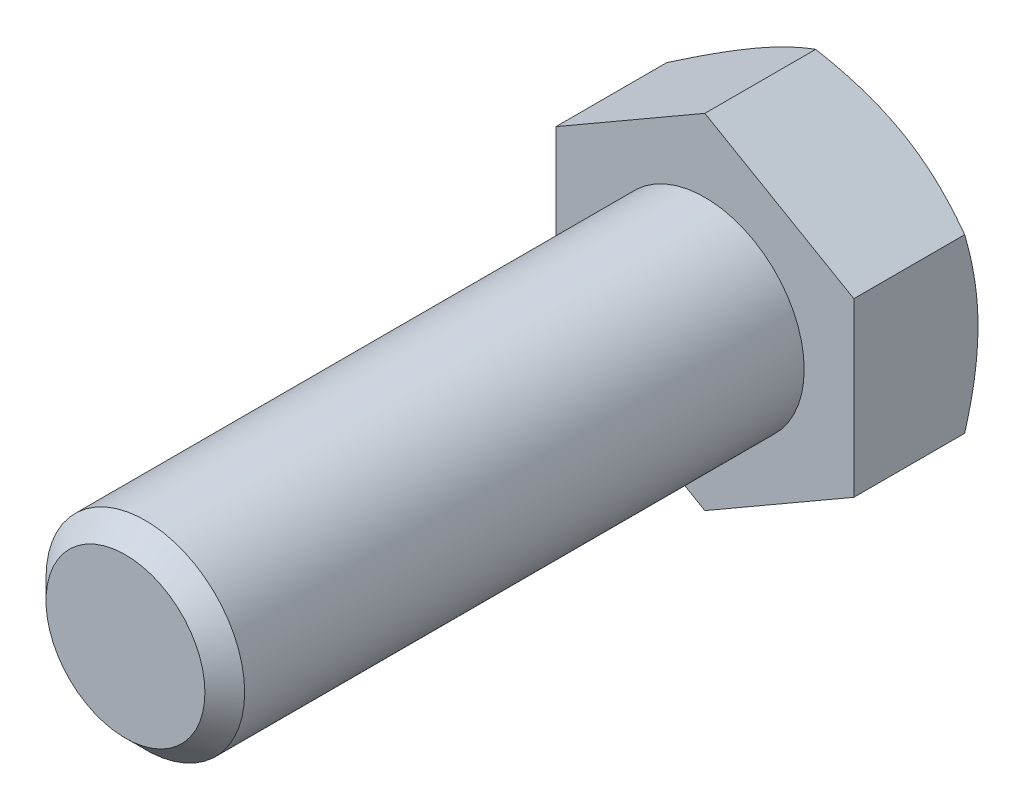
from build123d import *

# Parameters (mm, degrees)
ESQUISSE1_W        = 6
ESQUISSE1_H        = 35
CHANFREIN1_SIZE    = 1.2
BOSS_EXTRU_1_DEPTH = 7.5


with BuildPart() as part:
    # Esquisse1 → Base-R_volution (revolve)
    with BuildSketch(Plane(origin=(0, 0, 0), x_dir=(1, 0, 0), z_dir=(0, 1, 0))):
        with Locations((3, -17.5)):
            Rectangle(ESQUISSE1_W, ESQUISSE1_H)
    revolve(axis=Axis((0, 0, 0), (0, 0, 1)))

    # Chanfrein1
    chanfrein1_edges = [part.edges().sort_by_distance(p)[0] for p in [
        (-6, 0, 35),
    ]]
    chamfer(chanfrein1_edges, length=CHANFREIN1_SIZE)

    # Esquisse6 → Boss.-Extru.1 (add)
    with BuildSketch(Plane.XY):
        Polygon((9, -5.196152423), (9, 5.196152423), (0, 10.392304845), (-9, 5.196152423), (-9, -5.196152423), (0, -10.392304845), align=None)
    extrude(amount=-BOSS_EXTRU_1_DEPTH)

    # Esquisse7 → Enl_vement de mati_re-R_volution1 (revolve, cut)
    with BuildSketch(Plane(origin=(0, 0, 0), x_dir=(1, 0, 0), z_dir=(0, 1, 0))):
        Polygon((-9, 7.5), (-21.990381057, 7.5), (-21.990381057, 0), align=None)
    revolve(axis=Axis((0, 0, -6.239446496), (0, 0, 1)), mode=Mode.SUBTRACT)


solid = part.part
